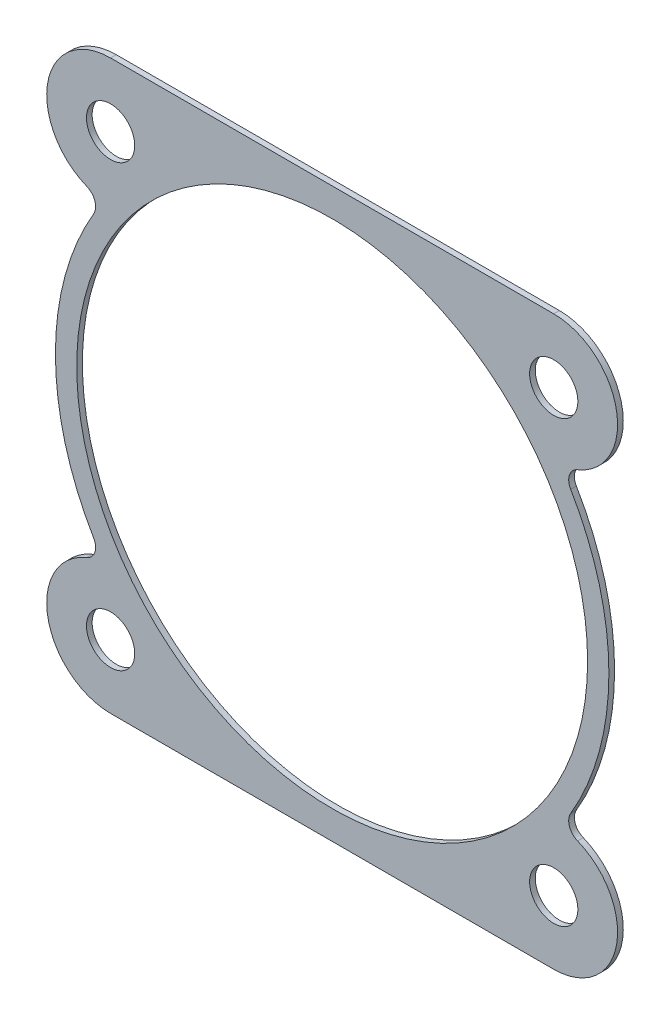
from build123d import *

# Parameters (mm, degrees)
BASE_EXTRUSION_DEPTH    = 0.2
PER_AGE1_D              = 3.4
ESQUISSE4_R             = 18
ENL_V_MAT_EXTRU_1_DEPTH = 29.366749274


with BuildPart() as part:
    # Esquisse1 → Base-Extrusion (new, symmetric)
    with BuildSketch(Plane.XY):
        with BuildLine():
            Line((15.612495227, 19.999999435), (-15.612495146, 20.000000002))
            ThreePointArc((-15.612495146, 20.000000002), (-20.030296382, 16.356172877), (-17.293563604, 11.325791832))
            ThreePointArc((-17.293563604, 11.325791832), (-16.720441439, 10.720328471), (-16.805322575, 9.890961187))
            ThreePointArc((-16.805322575, 9.890961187), (-19.499999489, -4.31e-07), (-16.805322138, -9.89096193))
            ThreePointArc((-16.805322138, -9.89096193), (-16.720440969, -10.720328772), (-17.293562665, -11.325791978))
            ThreePointArc((-17.293562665, -11.325791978), (-20.030295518, -16.356172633), (-15.612495, -19.999999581))
            Line((-15.612495, -19.999999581), (15.612495, -19.999999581))
            ThreePointArc((15.612495, -19.999999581), (20.030295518, -16.356172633), (17.293562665, -11.325791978))
            ThreePointArc((17.293562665, -11.325791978), (16.720440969, -10.720328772), (16.805322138, -9.89096193))
            ThreePointArc((16.805322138, -9.89096193), (19.499999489, -4.31e-07), (16.805322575, 9.890961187))
            ThreePointArc((16.805322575, 9.890961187), (16.720441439, 10.720328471), (17.293563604, 11.325791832))
            ThreePointArc((17.293563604, 11.325791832), (20.030296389, 16.356172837), (15.612495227, 19.999999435))
        make_face()
    extrude(amount=BASE_EXTRUSION_DEPTH, both=True)

    # Per_age1 (through all)
    with Locations(Plane.XY.offset(0.2)):
        with Locations((15.612495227, 15.499999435), (-15.612495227, 15.499999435), (-15.612494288, -15.499999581), (15.612494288, -15.499999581)):
            Hole(PER_AGE1_D / 2)

    # Esquisse4 → Enl_v. mat.-Extru.1 (cut, through all)
    with BuildSketch(Plane.XY.offset(0.2)):
        Circle(ESQUISSE4_R)
    extrude(amount=-ENL_V_MAT_EXTRU_1_DEPTH, mode=Mode.SUBTRACT)


solid = part.part
